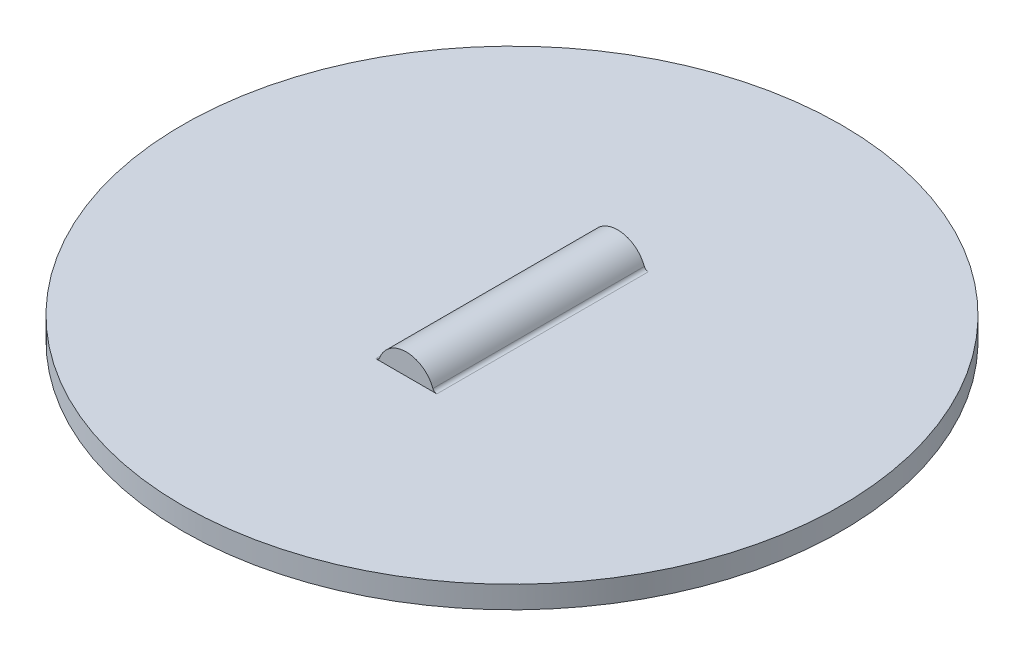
ISO-10303-21;
HEADER;
FILE_DESCRIPTION(('STEP AP214'),'2;1');
FILE_NAME('part.step','',(''),(''),'','','');
FILE_SCHEMA(('AUTOMOTIVE_DESIGN { 1 0 10303 214 1 1 1 1 }'));
ENDSEC;
DATA;
#1=APPLICATION_CONTEXT('core data for automotive mechanical design processes');
#2=APPLICATION_PROTOCOL_DEFINITION('international standard','automotive_design',2000,#1);
#3=PRODUCT_CONTEXT('',#1,'mechanical');
#4=PRODUCT('Part','Part','',(#3));
#5=PRODUCT_RELATED_PRODUCT_CATEGORY('part','',(#4));
#6=PRODUCT_DEFINITION_FORMATION('','',#4);
#7=PRODUCT_DEFINITION_CONTEXT('part definition',#1,'design');
#8=PRODUCT_DEFINITION('design','',#6,#7);
#9=PRODUCT_DEFINITION_SHAPE('','',#8);
#10=(LENGTH_UNIT() NAMED_UNIT(*) SI_UNIT(.MILLI.,.METRE.));
#11=(NAMED_UNIT(*) PLANE_ANGLE_UNIT() SI_UNIT($,.RADIAN.));
#12=(NAMED_UNIT(*) SI_UNIT($,.STERADIAN.) SOLID_ANGLE_UNIT());
#13=UNCERTAINTY_MEASURE_WITH_UNIT(LENGTH_MEASURE(1.E-05),#10,'distance_accuracy_value','');
#14=(GEOMETRIC_REPRESENTATION_CONTEXT(3) GLOBAL_UNCERTAINTY_ASSIGNED_CONTEXT((#13)) GLOBAL_UNIT_ASSIGNED_CONTEXT((#10,
#11,#12)) REPRESENTATION_CONTEXT('',''));
#15=CARTESIAN_POINT('',(0.,0.,0.));
#16=DIRECTION('',(0.,0.,1.));
#17=DIRECTION('',(1.,0.,0.));
#18=AXIS2_PLACEMENT_3D('',#15,#16,#17);
#19=CARTESIAN_POINT('',(0.,-0.3556,0.));
#20=DIRECTION('',(0.,0.,1.));
#21=DIRECTION('',(1.,0.,0.));
#22=AXIS2_PLACEMENT_3D('',#19,#20,#21);
#23=CYLINDRICAL_SURFACE('',#22,0.3048);
#24=DIRECTION('',(0.,0.,1.));
#25=VECTOR('',#24,1.);
#26=CARTESIAN_POINT('',(-0.284965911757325,-0.247445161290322,0.));
#27=LINE('',#26,#25);
#28=CARTESIAN_POINT('',(-0.284965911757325,-0.247445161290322,0.));
#29=VERTEX_POINT('',#28);
#30=CARTESIAN_POINT('',(-0.284965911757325,-0.247445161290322,10.1854));
#31=VERTEX_POINT('',#30);
#32=EDGE_CURVE('E111',#29,#31,#27,.T.);
#33=ORIENTED_EDGE('',*,*,#32,.F.);
#34=CARTESIAN_POINT('',(0.,-0.3556,0.));
#35=DIRECTION('',(0.,0.,1.));
#36=DIRECTION('',(1.,0.,0.));
#37=AXIS2_PLACEMENT_3D('',#34,#35,#36);
#38=CIRCLE('',#37,0.3048);
#39=CARTESIAN_POINT('',(0.284965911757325,-0.247445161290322,0.));
#40=VERTEX_POINT('',#39);
#41=EDGE_CURVE('E114',#40,#29,#38,.T.);
#42=ORIENTED_EDGE('',*,*,#41,.F.);
#43=DIRECTION('',(0.,0.,1.));
#44=VECTOR('',#43,1.);
#45=CARTESIAN_POINT('',(0.284965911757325,-0.247445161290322,0.));
#46=LINE('',#45,#44);
#47=CARTESIAN_POINT('',(0.284965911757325,-0.247445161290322,10.1854));
#48=VERTEX_POINT('',#47);
#49=EDGE_CURVE('E88',#48,#40,#46,.F.);
#50=ORIENTED_EDGE('',*,*,#49,.F.);
#51=CARTESIAN_POINT('',(0.,-0.3556,10.1854));
#52=DIRECTION('',(0.,0.,1.));
#53=DIRECTION('',(1.,0.,0.));
#54=AXIS2_PLACEMENT_3D('',#51,#52,#53);
#55=CIRCLE('',#54,0.3048);
#56=EDGE_CURVE('E85',#48,#31,#55,.T.);
#57=ORIENTED_EDGE('',*,*,#56,.T.);
#58=EDGE_LOOP('',(#33,#42,#50,#57));
#59=FACE_BOUND('',#58,.T.);
#60=ADVANCED_FACE('F18',(#59),#23,.F.);
#61=CARTESIAN_POINT('',(1.47232387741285,0.2032,0.));
#62=DIRECTION('',(0.,0.,1.));
#63=DIRECTION('',(1.,0.,0.));
#64=AXIS2_PLACEMENT_3D('',#61,#62,#63);
#65=CYLINDRICAL_SURFACE('',#64,1.27);
#66=CARTESIAN_POINT('',(1.47232387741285,0.2032,0.));
#67=DIRECTION('',(0.,0.,1.));
#68=DIRECTION('',(1.,0.,0.));
#69=AXIS2_PLACEMENT_3D('',#66,#67,#68);
#70=CIRCLE('',#69,1.27);
#71=CARTESIAN_POINT('',(1.47232387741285,-1.0668,0.));
#72=VERTEX_POINT('',#71);
#73=EDGE_CURVE('E101',#72,#40,#70,.F.);
#74=ORIENTED_EDGE('',*,*,#73,.F.);
#75=DIRECTION('',(0.,0.,1.));
#76=VECTOR('',#75,1.);
#77=CARTESIAN_POINT('',(1.47232387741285,-1.0668,10.1854));
#78=LINE('',#77,#76);
#79=CARTESIAN_POINT('',(1.47232387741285,-1.0668,10.1854));
#80=VERTEX_POINT('',#79);
#81=EDGE_CURVE('E94',#72,#80,#78,.T.);
#82=ORIENTED_EDGE('',*,*,#81,.T.);
#83=CARTESIAN_POINT('',(1.47232387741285,0.2032,10.1854));
#84=DIRECTION('',(0.,0.,1.));
#85=DIRECTION('',(1.,0.,0.));
#86=AXIS2_PLACEMENT_3D('',#83,#84,#85);
#87=CIRCLE('',#86,1.27);
#88=EDGE_CURVE('E21',#80,#48,#87,.F.);
#89=ORIENTED_EDGE('',*,*,#88,.T.);
#90=ORIENTED_EDGE('',*,*,#49,.T.);
#91=EDGE_LOOP('',(#74,#82,#89,#90));
#92=FACE_BOUND('',#91,.T.);
#93=ADVANCED_FACE('F99',(#92),#65,.T.);
#94=CARTESIAN_POINT('',(0.,-0.3556,10.1854));
#95=DIRECTION('',(0.,0.,1.));
#96=DIRECTION('',(1.,0.,0.));
#97=AXIS2_PLACEMENT_3D('',#94,#95,#96);
#98=PLANE('',#97);
#99=ORIENTED_EDGE('',*,*,#88,.F.);
#100=DIRECTION('',(1.,0.,0.));
#101=VECTOR('',#100,1.);
#102=CARTESIAN_POINT('',(-15.875,-1.0668,10.1854));
#103=LINE('',#102,#101);
#104=CARTESIAN_POINT('',(-1.47232387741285,-1.0668,10.1854));
#105=VERTEX_POINT('',#104);
#106=EDGE_CURVE('E84',#80,#105,#103,.F.);
#107=ORIENTED_EDGE('',*,*,#106,.T.);
#108=CARTESIAN_POINT('',(-1.47232387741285,0.2032,10.1854));
#109=DIRECTION('',(0.,0.,1.));
#110=DIRECTION('',(1.,0.,0.));
#111=AXIS2_PLACEMENT_3D('',#108,#109,#110);
#112=CIRCLE('',#111,1.27);
#113=EDGE_CURVE('E115',#31,#105,#112,.F.);
#114=ORIENTED_EDGE('',*,*,#113,.F.);
#115=ORIENTED_EDGE('',*,*,#56,.F.);
#116=EDGE_LOOP('',(#99,#107,#114,#115));
#117=FACE_BOUND('',#116,.T.);
#118=ADVANCED_FACE('F82',(#117),#98,.F.);
#119=CARTESIAN_POINT('',(-1.47232387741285,0.2032,0.));
#120=DIRECTION('',(0.,0.,1.));
#121=DIRECTION('',(1.,0.,0.));
#122=AXIS2_PLACEMENT_3D('',#119,#120,#121);
#123=CYLINDRICAL_SURFACE('',#122,1.27);
#124=CARTESIAN_POINT('',(-1.47232387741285,0.2032,0.));
#125=DIRECTION('',(0.,0.,1.));
#126=DIRECTION('',(1.,0.,0.));
#127=AXIS2_PLACEMENT_3D('',#124,#125,#126);
#128=CIRCLE('',#127,1.27);
#129=CARTESIAN_POINT('',(-1.47232387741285,-1.0668,0.));
#130=VERTEX_POINT('',#129);
#131=EDGE_CURVE('E104',#29,#130,#128,.F.);
#132=ORIENTED_EDGE('',*,*,#131,.F.);
#133=ORIENTED_EDGE('',*,*,#32,.T.);
#134=ORIENTED_EDGE('',*,*,#113,.T.);
#135=DIRECTION('',(0.,0.,1.));
#136=VECTOR('',#135,1.);
#137=CARTESIAN_POINT('',(-1.47232387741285,-1.0668,10.1854));
#138=LINE('',#137,#136);
#139=EDGE_CURVE('E97',#105,#130,#138,.F.);
#140=ORIENTED_EDGE('',*,*,#139,.T.);
#141=EDGE_LOOP('',(#132,#133,#134,#140));
#142=FACE_BOUND('',#141,.T.);
#143=ADVANCED_FACE('F147',(#142),#123,.T.);
#144=CARTESIAN_POINT('',(0.,-0.3556,0.));
#145=DIRECTION('',(0.,0.,1.));
#146=DIRECTION('',(1.,0.,0.));
#147=AXIS2_PLACEMENT_3D('',#144,#145,#146);
#148=PLANE('',#147);
#149=DIRECTION('',(1.,0.,0.));
#150=VECTOR('',#149,1.);
#151=CARTESIAN_POINT('',(-15.875,-1.0668,0.));
#152=LINE('',#151,#150);
#153=EDGE_CURVE('E107',#130,#72,#152,.T.);
#154=ORIENTED_EDGE('',*,*,#153,.T.);
#155=ORIENTED_EDGE('',*,*,#73,.T.);
#156=ORIENTED_EDGE('',*,*,#41,.T.);
#157=ORIENTED_EDGE('',*,*,#131,.T.);
#158=EDGE_LOOP('',(#154,#155,#156,#157));
#159=FACE_BOUND('',#158,.T.);
#160=ADVANCED_FACE('F149',(#159),#148,.T.);
#161=CARTESIAN_POINT('',(-15.875,-1.0668,10.1854));
#162=DIRECTION('',(0.,1.,0.));
#163=DIRECTION('',(0.,0.,1.));
#164=AXIS2_PLACEMENT_3D('',#161,#162,#163);
#165=PLANE('',#164);
#166=ORIENTED_EDGE('',*,*,#139,.F.);
#167=ORIENTED_EDGE('',*,*,#106,.F.);
#168=ORIENTED_EDGE('',*,*,#81,.F.);
#169=ORIENTED_EDGE('',*,*,#153,.F.);
#170=EDGE_LOOP('',(#166,#167,#168,#169));
#171=FACE_BOUND('',#170,.T.);
#172=CARTESIAN_POINT('',(0.,-1.0668,5.0927));
#173=DIRECTION('',(0.,-1.,0.));
#174=DIRECTION('',(0.,0.,-1.));
#175=AXIS2_PLACEMENT_3D('',#172,#173,#174);
#176=CIRCLE('',#175,15.875);
#177=CARTESIAN_POINT('',(0.,-1.0668,-10.7823));
#178=VERTEX_POINT('',#177);
#179=EDGE_CURVE('E136',#178,#178,#176,.F.);
#180=ORIENTED_EDGE('',*,*,#179,.F.);
#181=EDGE_LOOP('',(#180));
#182=FACE_BOUND('',#181,.T.);
#183=ADVANCED_FACE('F91',(#171,#182),#165,.F.);
#184=CARTESIAN_POINT('',(0.,-0.3556,10.1854));
#185=DIRECTION('',(0.,0.,-1.));
#186=DIRECTION('',(-1.,0.,0.));
#187=AXIS2_PLACEMENT_3D('',#184,#185,#186);
#188=CYLINDRICAL_SURFACE('',#187,1.3716);
#189=CARTESIAN_POINT('',(0.,-0.3556,0.));
#190=DIRECTION('',(0.,0.,-1.));
#191=DIRECTION('',(-1.,0.,0.));
#192=AXIS2_PLACEMENT_3D('',#189,#190,#191);
#193=CIRCLE('',#192,1.3716);
#194=CARTESIAN_POINT('',(-1.28234660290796,0.131096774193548,0.));
#195=VERTEX_POINT('',#194);
#196=CARTESIAN_POINT('',(1.28234660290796,0.131096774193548,0.));
#197=VERTEX_POINT('',#196);
#198=EDGE_CURVE('E134',#195,#197,#193,.T.);
#199=ORIENTED_EDGE('',*,*,#198,.F.);
#200=DIRECTION('',(0.,0.,-1.));
#201=VECTOR('',#200,1.);
#202=CARTESIAN_POINT('',(-1.28234660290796,0.131096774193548,10.1854));
#203=LINE('',#202,#201);
#204=CARTESIAN_POINT('',(-1.28234660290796,0.131096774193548,10.1854));
#205=VERTEX_POINT('',#204);
#206=EDGE_CURVE('E130',#195,#205,#203,.F.);
#207=ORIENTED_EDGE('',*,*,#206,.T.);
#208=CARTESIAN_POINT('',(0.,-0.3556,10.1854));
#209=DIRECTION('',(0.,0.,-1.));
#210=DIRECTION('',(-1.,0.,0.));
#211=AXIS2_PLACEMENT_3D('',#208,#209,#210);
#212=CIRCLE('',#211,1.3716);
#213=CARTESIAN_POINT('',(1.28234660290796,0.131096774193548,10.1854));
#214=VERTEX_POINT('',#213);
#215=EDGE_CURVE('E125',#205,#214,#212,.T.);
#216=ORIENTED_EDGE('',*,*,#215,.T.);
#217=DIRECTION('',(0.,0.,-1.));
#218=VECTOR('',#217,1.);
#219=CARTESIAN_POINT('',(1.28234660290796,0.131096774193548,10.1854));
#220=LINE('',#219,#218);
#221=EDGE_CURVE('E120',#214,#197,#220,.T.);
#222=ORIENTED_EDGE('',*,*,#221,.T.);
#223=EDGE_LOOP('',(#199,#207,#216,#222));
#224=FACE_BOUND('',#223,.T.);
#225=ADVANCED_FACE('F176',(#224),#188,.T.);
#226=CARTESIAN_POINT('',(0.,0.,5.0927));
#227=DIRECTION('',(0.,-1.,0.));
#228=DIRECTION('',(0.,0.,-1.));
#229=AXIS2_PLACEMENT_3D('',#226,#227,#228);
#230=CYLINDRICAL_SURFACE('',#229,15.875);
#231=ORIENTED_EDGE('',*,*,#179,.T.);
#232=EDGE_LOOP('',(#231));
#233=FACE_BOUND('',#232,.T.);
#234=CARTESIAN_POINT('',(0.,0.,5.0927));
#235=DIRECTION('',(0.,-1.,0.));
#236=DIRECTION('',(0.,0.,-1.));
#237=AXIS2_PLACEMENT_3D('',#234,#235,#236);
#238=CIRCLE('',#237,15.875);
#239=CARTESIAN_POINT('',(0.,0.,-10.7823));
#240=VERTEX_POINT('',#239);
#241=EDGE_CURVE('E116',#240,#240,#238,.T.);
#242=ORIENTED_EDGE('',*,*,#241,.T.);
#243=EDGE_LOOP('',(#242));
#244=FACE_BOUND('',#243,.T.);
#245=ADVANCED_FACE('F178',(#233,#244),#230,.T.);
#246=CARTESIAN_POINT('',(-1.47232387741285,0.2032,0.));
#247=DIRECTION('',(0.,0.,-1.));
#248=DIRECTION('',(-1.,0.,0.));
#249=AXIS2_PLACEMENT_3D('',#246,#247,#248);
#250=PLANE('',#249);
#251=CARTESIAN_POINT('',(-1.47232387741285,0.2032,0.));
#252=DIRECTION('',(0.,0.,-1.));
#253=DIRECTION('',(-1.,0.,0.));
#254=AXIS2_PLACEMENT_3D('',#251,#252,#253);
#255=CIRCLE('',#254,0.2032);
#256=CARTESIAN_POINT('',(-1.47232387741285,0.,0.));
#257=VERTEX_POINT('',#256);
#258=EDGE_CURVE('E131',#257,#195,#255,.F.);
#259=ORIENTED_EDGE('',*,*,#258,.T.);
#260=ORIENTED_EDGE('',*,*,#198,.T.);
#261=CARTESIAN_POINT('',(1.47232387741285,0.2032,0.));
#262=DIRECTION('',(0.,0.,-1.));
#263=DIRECTION('',(-1.,0.,0.));
#264=AXIS2_PLACEMENT_3D('',#261,#262,#263);
#265=CIRCLE('',#264,0.2032);
#266=CARTESIAN_POINT('',(1.47232387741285,0.,0.));
#267=VERTEX_POINT('',#266);
#268=EDGE_CURVE('E122',#197,#267,#265,.F.);
#269=ORIENTED_EDGE('',*,*,#268,.T.);
#270=DIRECTION('',(1.,0.,0.));
#271=VECTOR('',#270,1.);
#272=CARTESIAN_POINT('',(1.47232387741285,0.,0.));
#273=LINE('',#272,#271);
#274=EDGE_CURVE('E119',#267,#257,#273,.F.);
#275=ORIENTED_EDGE('',*,*,#274,.T.);
#276=EDGE_LOOP('',(#259,#260,#269,#275));
#277=FACE_BOUND('',#276,.T.);
#278=ADVANCED_FACE('F169',(#277),#250,.T.);
#279=CARTESIAN_POINT('',(-1.47232387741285,0.2032,10.1854));
#280=DIRECTION('',(0.,0.,-1.));
#281=DIRECTION('',(-1.,0.,0.));
#282=AXIS2_PLACEMENT_3D('',#279,#280,#281);
#283=CYLINDRICAL_SURFACE('',#282,0.2032);
#284=CARTESIAN_POINT('',(-1.47232387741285,0.2032,10.1854));
#285=DIRECTION('',(0.,0.,-1.));
#286=DIRECTION('',(-1.,0.,0.));
#287=AXIS2_PLACEMENT_3D('',#284,#285,#286);
#288=CIRCLE('',#287,0.2032);
#289=CARTESIAN_POINT('',(-1.47232387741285,0.,10.1854));
#290=VERTEX_POINT('',#289);
#291=EDGE_CURVE('E127',#290,#205,#288,.F.);
#292=ORIENTED_EDGE('',*,*,#291,.T.);
#293=ORIENTED_EDGE('',*,*,#206,.F.);
#294=ORIENTED_EDGE('',*,*,#258,.F.);
#295=DIRECTION('',(0.,0.,1.));
#296=VECTOR('',#295,1.);
#297=CARTESIAN_POINT('',(-1.47232387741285,0.,10.1854));
#298=LINE('',#297,#296);
#299=EDGE_CURVE('E155',#257,#290,#298,.T.);
#300=ORIENTED_EDGE('',*,*,#299,.T.);
#301=EDGE_LOOP('',(#292,#293,#294,#300));
#302=FACE_BOUND('',#301,.T.);
#303=ADVANCED_FACE('F162',(#302),#283,.F.);
#304=CARTESIAN_POINT('',(-1.47232387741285,0.2032,10.1854));
#305=DIRECTION('',(0.,0.,-1.));
#306=DIRECTION('',(-1.,0.,0.));
#307=AXIS2_PLACEMENT_3D('',#304,#305,#306);
#308=PLANE('',#307);
#309=CARTESIAN_POINT('',(1.47232387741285,0.2032,10.1854));
#310=DIRECTION('',(0.,0.,-1.));
#311=DIRECTION('',(-1.,0.,0.));
#312=AXIS2_PLACEMENT_3D('',#309,#310,#311);
#313=CIRCLE('',#312,0.2032);
#314=CARTESIAN_POINT('',(1.47232387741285,0.,10.1854));
#315=VERTEX_POINT('',#314);
#316=EDGE_CURVE('E35',#315,#214,#313,.T.);
#317=ORIENTED_EDGE('',*,*,#316,.T.);
#318=ORIENTED_EDGE('',*,*,#215,.F.);
#319=ORIENTED_EDGE('',*,*,#291,.F.);
#320=DIRECTION('',(1.,0.,0.));
#321=VECTOR('',#320,1.);
#322=CARTESIAN_POINT('',(1.47232387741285,0.,10.1854));
#323=LINE('',#322,#321);
#324=EDGE_CURVE('E27',#290,#315,#323,.T.);
#325=ORIENTED_EDGE('',*,*,#324,.T.);
#326=EDGE_LOOP('',(#317,#318,#319,#325));
#327=FACE_BOUND('',#326,.T.);
#328=ADVANCED_FACE('F173',(#327),#308,.F.);
#329=CARTESIAN_POINT('',(1.47232387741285,0.2032,10.1854));
#330=DIRECTION('',(0.,0.,-1.));
#331=DIRECTION('',(-1.,0.,0.));
#332=AXIS2_PLACEMENT_3D('',#329,#330,#331);
#333=CYLINDRICAL_SURFACE('',#332,0.2032);
#334=ORIENTED_EDGE('',*,*,#316,.F.);
#335=DIRECTION('',(0.,0.,1.));
#336=VECTOR('',#335,1.);
#337=CARTESIAN_POINT('',(1.47232387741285,0.,10.1854));
#338=LINE('',#337,#336);
#339=EDGE_CURVE('E11',#315,#267,#338,.F.);
#340=ORIENTED_EDGE('',*,*,#339,.T.);
#341=ORIENTED_EDGE('',*,*,#268,.F.);
#342=ORIENTED_EDGE('',*,*,#221,.F.);
#343=EDGE_LOOP('',(#334,#340,#341,#342));
#344=FACE_BOUND('',#343,.T.);
#345=ADVANCED_FACE('F171',(#344),#333,.F.);
#346=CARTESIAN_POINT('',(1.47232387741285,0.,10.1854));
#347=DIRECTION('',(0.,-1.,0.));
#348=DIRECTION('',(1.,0.,0.));
#349=AXIS2_PLACEMENT_3D('',#346,#347,#348);
#350=PLANE('',#349);
#351=ORIENTED_EDGE('',*,*,#324,.F.);
#352=ORIENTED_EDGE('',*,*,#299,.F.);
#353=ORIENTED_EDGE('',*,*,#274,.F.);
#354=ORIENTED_EDGE('',*,*,#339,.F.);
#355=EDGE_LOOP('',(#351,#352,#353,#354));
#356=FACE_BOUND('',#355,.T.);
#357=ORIENTED_EDGE('',*,*,#241,.F.);
#358=EDGE_LOOP('',(#357));
#359=FACE_BOUND('',#358,.T.);
#360=ADVANCED_FACE('F166',(#356,#359),#350,.F.);
#361=CLOSED_SHELL('',(#60,#93,#118,#143,#160,#183,#225,#245,#278,#303,#328,#345,#360));
#362=MANIFOLD_SOLID_BREP('B1',#361);
#363=ADVANCED_BREP_SHAPE_REPRESENTATION('',(#18,#362),#14);
#364=SHAPE_DEFINITION_REPRESENTATION(#9,#363);
ENDSEC;
END-ISO-10303-21;
